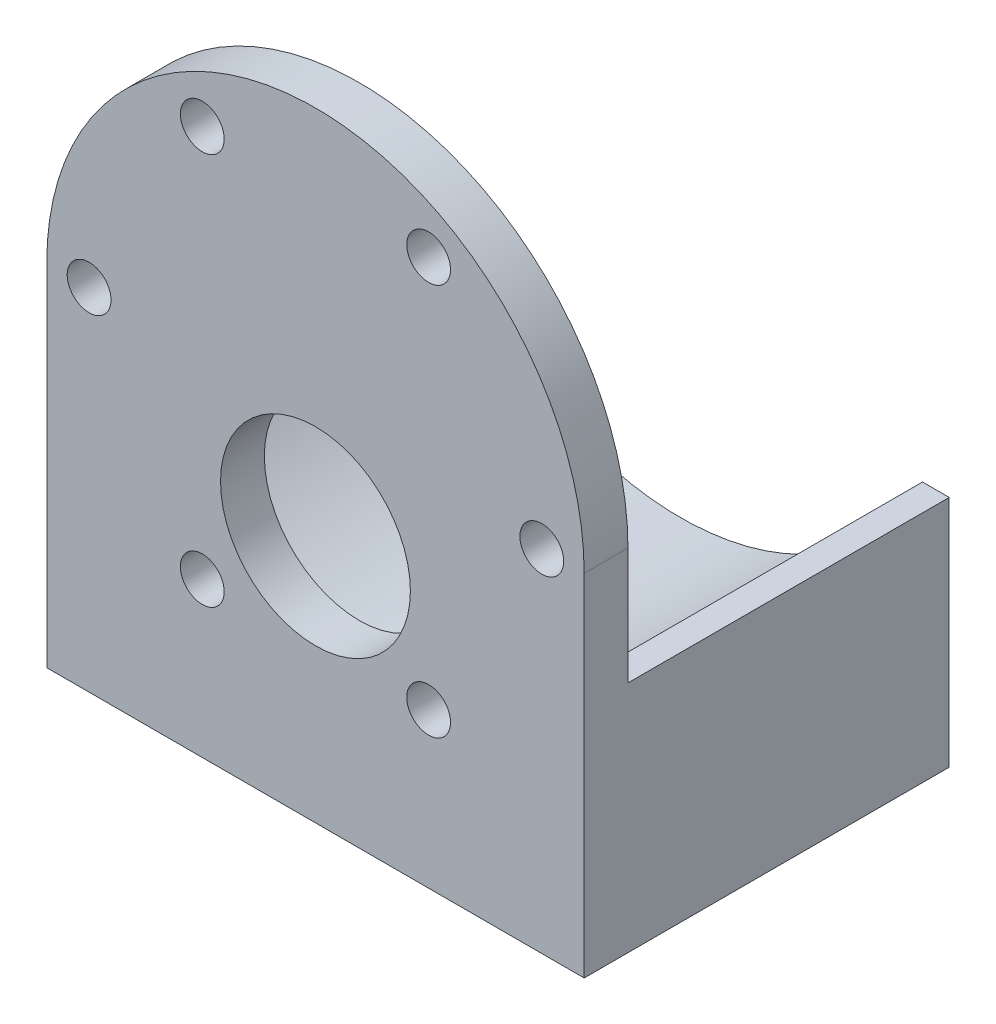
from build123d import *

# Parameters (mm, degrees)
SKETCH1_R           = 18.4
SKETCH1_R_2         = 1.5
BOSS_EXTRUDE1_DEPTH = 3
SKETCH2_R           = 6.5
CUT_EXTRUDE1_DEPTH  = 3
BOSS_EXTRUDE3_START = -5
BOSS_EXTRUDE3_DEPTH = 5
SKETCH4_W           = 2
SKETCH4_H           = 8
CUT_EXTRUDE2_DEPTH  = 62
BOSS_EXTRUDE4_START = 20
BOSS_EXTRUDE4_DEPTH = 20


with BuildPart() as part:
    # Sketch1 → Boss-Extrude1 (new body)
    with BuildSketch(Plane.XY):
        Circle(SKETCH1_R)
        with Locations((7.75, 13.423393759)):
            Circle(SKETCH1_R_2, mode=Mode.SUBTRACT)
        with Locations((-7.75, 13.423393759)):
            Circle(SKETCH1_R_2, mode=Mode.SUBTRACT)
        with Locations((-15.5, 0)):
            Circle(SKETCH1_R_2, mode=Mode.SUBTRACT)
        with Locations((15.5, 0)):
            Circle(SKETCH1_R_2, mode=Mode.SUBTRACT)
        with Locations((-7.75, -13.423393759)):
            Circle(SKETCH1_R_2, mode=Mode.SUBTRACT)
        with Locations((7.75, -13.423393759)):
            Circle(SKETCH1_R_2, mode=Mode.SUBTRACT)
    extrude(amount=BOSS_EXTRUDE1_DEPTH)

    # Sketch2 → Cut-Extrude1 (cut)
    with BuildSketch(Plane.XY.offset(3)):
        with Locations((0, -7)):
            Circle(SKETCH2_R)
    extrude(amount=-CUT_EXTRUDE1_DEPTH, mode=Mode.SUBTRACT)

    # Sketch3 → Boss-Extrude3 (add)
    with BuildSketch(Plane.XY.offset(3).offset(BOSS_EXTRUDE3_START)):
        with BuildLine():
            Line((-18.4, 0), (-18.4, -24))
            Line((-18.4, -24), (18.4, -24))
            Line((18.4, -24), (18.4, 0))
            ThreePointArc((18.4, 0), (0, -18.4), (-18.4, 0))
        make_face()
    extrude(amount=BOSS_EXTRUDE3_DEPTH)

    # Sketch4 → Cut-Extrude2 (cut)
    with BuildSketch(Plane(origin=(18.4, 0, 0), x_dir=(0, 0, -1), z_dir=(1, 0, 0))):
        with Locations((1, -4)):
            Rectangle(SKETCH4_W, SKETCH4_H)
    extrude(amount=-CUT_EXTRUDE2_DEPTH, mode=Mode.SUBTRACT)

    # Sketch5 → Boss-Extrude4 (add)
    with BuildSketch(Plane(origin=(0, 0, -2), x_dir=(-1, 0, 0), z_dir=(0, 0, -1)).offset(BOSS_EXTRUDE4_START)):
        with BuildLine():
            Line((-18.4, -24), (-18.4, -8))
            Line((-18.4, -8), (-16.569852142, -8))
            ThreePointArc((-16.569852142, -8), (0, -18.4), (16.569852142, -8))
            Line((16.569852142, -8), (18.4, -8))
            Line((18.4, -8), (18.4, -24))
            Line((18.4, -24), (-18.4, -24))
        make_face()
    extrude(amount=-BOSS_EXTRUDE4_DEPTH)


solid = part.part
